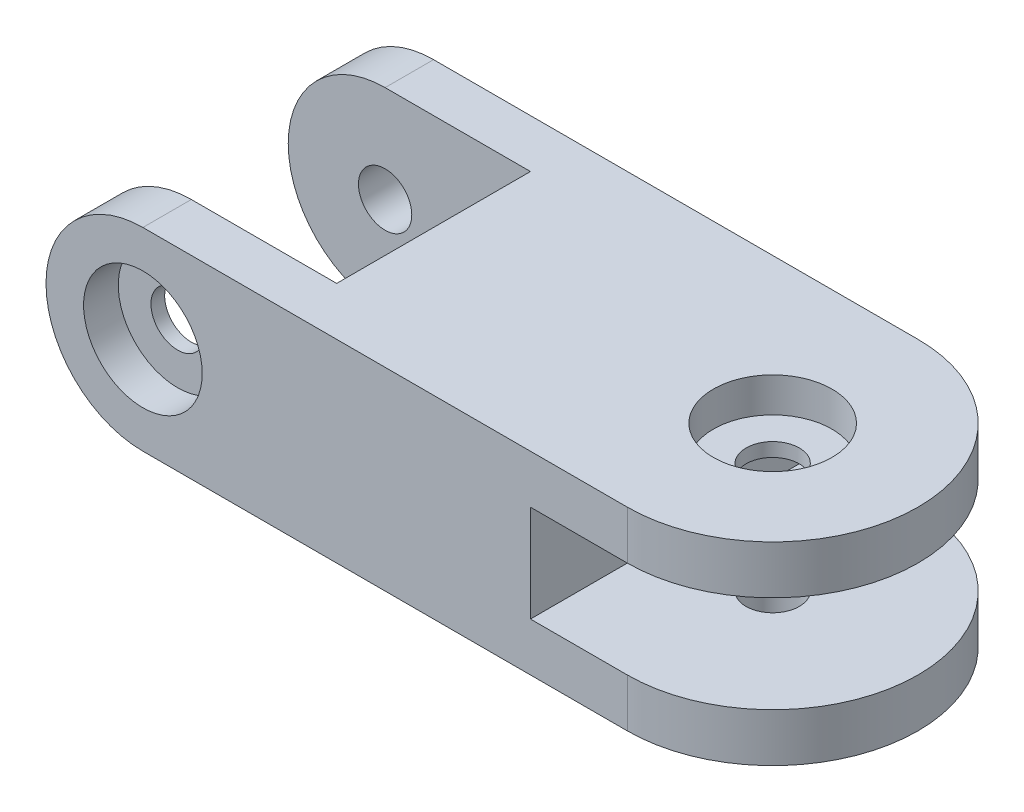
ISO-10303-21;
HEADER;
FILE_DESCRIPTION(('STEP AP214'),'2;1');
FILE_NAME('part.step','',(''),(''),'','','');
FILE_SCHEMA(('AUTOMOTIVE_DESIGN { 1 0 10303 214 1 1 1 1 }'));
ENDSEC;
DATA;
#1=APPLICATION_CONTEXT('core data for automotive mechanical design processes');
#2=APPLICATION_PROTOCOL_DEFINITION('international standard','automotive_design',2000,#1);
#3=PRODUCT_CONTEXT('',#1,'mechanical');
#4=PRODUCT('Part','Part','',(#3));
#5=PRODUCT_RELATED_PRODUCT_CATEGORY('part','',(#4));
#6=PRODUCT_DEFINITION_FORMATION('','',#4);
#7=PRODUCT_DEFINITION_CONTEXT('part definition',#1,'design');
#8=PRODUCT_DEFINITION('design','',#6,#7);
#9=PRODUCT_DEFINITION_SHAPE('','',#8);
#10=(LENGTH_UNIT() NAMED_UNIT(*) SI_UNIT(.MILLI.,.METRE.));
#11=(NAMED_UNIT(*) PLANE_ANGLE_UNIT() SI_UNIT($,.RADIAN.));
#12=(NAMED_UNIT(*) SI_UNIT($,.STERADIAN.) SOLID_ANGLE_UNIT());
#13=UNCERTAINTY_MEASURE_WITH_UNIT(LENGTH_MEASURE(1.E-05),#10,'distance_accuracy_value','');
#14=(GEOMETRIC_REPRESENTATION_CONTEXT(3) GLOBAL_UNCERTAINTY_ASSIGNED_CONTEXT((#13)) GLOBAL_UNIT_ASSIGNED_CONTEXT((#10,
#11,#12)) REPRESENTATION_CONTEXT('',''));
#15=CARTESIAN_POINT('',(0.,0.,0.));
#16=DIRECTION('',(0.,0.,1.));
#17=DIRECTION('',(1.,0.,0.));
#18=AXIS2_PLACEMENT_3D('',#15,#16,#17);
#19=CARTESIAN_POINT('',(0.,20.,-15.));
#20=DIRECTION('',(0.,0.,-1.));
#21=DIRECTION('',(-1.,0.,0.));
#22=AXIS2_PLACEMENT_3D('',#19,#20,#21);
#23=PLANE('',#22);
#24=DIRECTION('',(1.,0.,0.));
#25=VECTOR('',#24,1.);
#26=CARTESIAN_POINT('',(0.,0.,-15.));
#27=LINE('',#26,#25);
#28=CARTESIAN_POINT('',(10.,0.,-15.));
#29=VERTEX_POINT('',#28);
#30=CARTESIAN_POINT('',(60.,0.,-15.));
#31=VERTEX_POINT('',#30);
#32=EDGE_CURVE('E182',#29,#31,#27,.T.);
#33=ORIENTED_EDGE('',*,*,#32,.F.);
#34=CARTESIAN_POINT('',(10.,10.,-15.));
#35=DIRECTION('',(0.,0.,-1.));
#36=DIRECTION('',(-1.,0.,0.));
#37=AXIS2_PLACEMENT_3D('',#34,#35,#36);
#38=CIRCLE('',#37,10.);
#39=CARTESIAN_POINT('',(10.,20.,-15.));
#40=VERTEX_POINT('',#39);
#41=EDGE_CURVE('E213',#29,#40,#38,.T.);
#42=ORIENTED_EDGE('',*,*,#41,.T.);
#43=DIRECTION('',(-1.,0.,0.));
#44=VECTOR('',#43,1.);
#45=CARTESIAN_POINT('',(0.,20.,-15.));
#46=LINE('',#45,#44);
#47=CARTESIAN_POINT('',(60.,20.,-15.));
#48=VERTEX_POINT('',#47);
#49=EDGE_CURVE('E184',#48,#40,#46,.T.);
#50=ORIENTED_EDGE('',*,*,#49,.F.);
#51=DIRECTION('',(0.,-1.,0.));
#52=VECTOR('',#51,1.);
#53=CARTESIAN_POINT('',(60.,0.,-15.));
#54=LINE('',#53,#52);
#55=CARTESIAN_POINT('',(60.,15.,-15.));
#56=VERTEX_POINT('',#55);
#57=EDGE_CURVE('E196',#48,#56,#54,.T.);
#58=ORIENTED_EDGE('',*,*,#57,.T.);
#59=DIRECTION('',(1.,0.,0.));
#60=VECTOR('',#59,1.);
#61=CARTESIAN_POINT('',(0.,15.,-15.));
#62=LINE('',#61,#60);
#63=CARTESIAN_POINT('',(50.,15.,-15.));
#64=VERTEX_POINT('',#63);
#65=EDGE_CURVE('E204',#64,#56,#62,.T.);
#66=ORIENTED_EDGE('',*,*,#65,.F.);
#67=DIRECTION('',(0.,-1.,0.));
#68=VECTOR('',#67,1.);
#69=CARTESIAN_POINT('',(50.,15.,-15.));
#70=LINE('',#69,#68);
#71=CARTESIAN_POINT('',(50.,5.,-15.));
#72=VERTEX_POINT('',#71);
#73=EDGE_CURVE('E167',#64,#72,#70,.T.);
#74=ORIENTED_EDGE('',*,*,#73,.T.);
#75=DIRECTION('',(1.,0.,0.));
#76=VECTOR('',#75,1.);
#77=CARTESIAN_POINT('',(75.,5.,-15.));
#78=LINE('',#77,#76);
#79=CARTESIAN_POINT('',(60.,5.,-15.));
#80=VERTEX_POINT('',#79);
#81=EDGE_CURVE('E170',#72,#80,#78,.T.);
#82=ORIENTED_EDGE('',*,*,#81,.T.);
#83=EDGE_CURVE('E195',#80,#31,#54,.T.);
#84=ORIENTED_EDGE('',*,*,#83,.T.);
#85=EDGE_LOOP('',(#33,#42,#50,#58,#66,#74,#82,#84));
#86=FACE_BOUND('',#85,.T.);
#87=CARTESIAN_POINT('',(10.,10.,-15.));
#88=DIRECTION('',(0.,0.,1.));
#89=DIRECTION('',(1.,0.,0.));
#90=AXIS2_PLACEMENT_3D('',#87,#88,#89);
#91=CIRCLE('',#90,2.74999999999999);
#92=CARTESIAN_POINT('',(12.75,10.,-15.));
#93=VERTEX_POINT('',#92);
#94=EDGE_CURVE('E229',#93,#93,#91,.T.);
#95=ORIENTED_EDGE('',*,*,#94,.T.);
#96=EDGE_LOOP('',(#95));
#97=FACE_BOUND('',#96,.T.);
#98=ADVANCED_FACE('F33',(#86,#97),#23,.T.);
#99=CARTESIAN_POINT('',(10.,10.,-15.));
#100=DIRECTION('',(0.,0.,-1.));
#101=DIRECTION('',(-1.,0.,0.));
#102=AXIS2_PLACEMENT_3D('',#99,#100,#101);
#103=CYLINDRICAL_SURFACE('',#102,10.);
#104=DIRECTION('',(0.,0.,-1.));
#105=VECTOR('',#104,1.);
#106=CARTESIAN_POINT('',(10.,0.,15.));
#107=LINE('',#106,#105);
#108=CARTESIAN_POINT('',(10.,0.,-10.));
#109=VERTEX_POINT('',#108);
#110=EDGE_CURVE('E209',#109,#29,#107,.T.);
#111=ORIENTED_EDGE('',*,*,#110,.F.);
#112=CARTESIAN_POINT('',(10.,10.,-10.));
#113=DIRECTION('',(0.,0.,-1.));
#114=DIRECTION('',(-1.,0.,0.));
#115=AXIS2_PLACEMENT_3D('',#112,#113,#114);
#116=CIRCLE('',#115,10.);
#117=CARTESIAN_POINT('',(10.,20.,-10.));
#118=VERTEX_POINT('',#117);
#119=EDGE_CURVE('E157',#118,#109,#116,.F.);
#120=ORIENTED_EDGE('',*,*,#119,.F.);
#121=DIRECTION('',(0.,0.,-1.));
#122=VECTOR('',#121,1.);
#123=CARTESIAN_POINT('',(10.,20.,15.));
#124=LINE('',#123,#122);
#125=EDGE_CURVE('E207',#40,#118,#124,.F.);
#126=ORIENTED_EDGE('',*,*,#125,.F.);
#127=ORIENTED_EDGE('',*,*,#41,.F.);
#128=EDGE_LOOP('',(#111,#120,#126,#127));
#129=FACE_BOUND('',#128,.T.);
#130=ADVANCED_FACE('F283',(#129),#103,.T.);
#131=CARTESIAN_POINT('',(10.,10.,10.));
#132=DIRECTION('',(0.,0.,1.));
#133=DIRECTION('',(1.,0.,0.));
#134=AXIS2_PLACEMENT_3D('',#131,#132,#133);
#135=CIRCLE('',#134,10.);
#136=CARTESIAN_POINT('',(10.,0.,10.));
#137=VERTEX_POINT('',#136);
#138=CARTESIAN_POINT('',(10.,20.,10.));
#139=VERTEX_POINT('',#138);
#140=EDGE_CURVE('E50',#137,#139,#135,.F.);
#141=ORIENTED_EDGE('',*,*,#140,.F.);
#142=CARTESIAN_POINT('',(10.,0.,15.));
#143=VERTEX_POINT('',#142);
#144=EDGE_CURVE('E210',#143,#137,#107,.T.);
#145=ORIENTED_EDGE('',*,*,#144,.F.);
#146=CARTESIAN_POINT('',(10.,10.,15.));
#147=DIRECTION('',(0.,0.,-1.));
#148=DIRECTION('',(-1.,0.,0.));
#149=AXIS2_PLACEMENT_3D('',#146,#147,#148);
#150=CIRCLE('',#149,10.);
#151=CARTESIAN_POINT('',(10.,20.,15.));
#152=VERTEX_POINT('',#151);
#153=EDGE_CURVE('E42',#152,#143,#150,.F.);
#154=ORIENTED_EDGE('',*,*,#153,.F.);
#155=EDGE_CURVE('E206',#139,#152,#124,.F.);
#156=ORIENTED_EDGE('',*,*,#155,.F.);
#157=EDGE_LOOP('',(#141,#145,#154,#156));
#158=FACE_BOUND('',#157,.T.);
#159=ADVANCED_FACE('F35',(#158),#103,.T.);
#160=CARTESIAN_POINT('',(60.,0.,0.));
#161=DIRECTION('',(0.,1.,0.));
#162=DIRECTION('',(0.,0.,1.));
#163=AXIS2_PLACEMENT_3D('',#160,#161,#162);
#164=CYLINDRICAL_SURFACE('',#163,15.);
#165=CARTESIAN_POINT('',(60.,5.,0.));
#166=DIRECTION('',(0.,-1.,0.));
#167=DIRECTION('',(1.,0.,0.));
#168=AXIS2_PLACEMENT_3D('',#165,#166,#167);
#169=CIRCLE('',#168,15.);
#170=CARTESIAN_POINT('',(60.,5.,15.));
#171=VERTEX_POINT('',#170);
#172=EDGE_CURVE('E180',#171,#80,#169,.F.);
#173=ORIENTED_EDGE('',*,*,#172,.F.);
#174=DIRECTION('',(0.,1.,0.));
#175=VECTOR('',#174,1.);
#176=CARTESIAN_POINT('',(60.,20.,15.));
#177=LINE('',#176,#175);
#178=CARTESIAN_POINT('',(60.,0.,15.));
#179=VERTEX_POINT('',#178);
#180=EDGE_CURVE('E192',#179,#171,#177,.T.);
#181=ORIENTED_EDGE('',*,*,#180,.F.);
#182=CARTESIAN_POINT('',(60.,0.,0.));
#183=DIRECTION('',(0.,1.,0.));
#184=DIRECTION('',(0.,0.,1.));
#185=AXIS2_PLACEMENT_3D('',#182,#183,#184);
#186=CIRCLE('',#185,15.);
#187=EDGE_CURVE('E199',#31,#179,#186,.F.);
#188=ORIENTED_EDGE('',*,*,#187,.F.);
#189=ORIENTED_EDGE('',*,*,#83,.F.);
#190=EDGE_LOOP('',(#173,#181,#188,#189));
#191=FACE_BOUND('',#190,.T.);
#192=ADVANCED_FACE('F275',(#191),#164,.T.);
#193=CARTESIAN_POINT('',(60.,15.,0.));
#194=DIRECTION('',(0.,1.,0.));
#195=DIRECTION('',(-1.,0.,0.));
#196=AXIS2_PLACEMENT_3D('',#193,#194,#195);
#197=CIRCLE('',#196,15.);
#198=CARTESIAN_POINT('',(60.,15.,15.));
#199=VERTEX_POINT('',#198);
#200=EDGE_CURVE('E176',#56,#199,#197,.F.);
#201=ORIENTED_EDGE('',*,*,#200,.F.);
#202=ORIENTED_EDGE('',*,*,#57,.F.);
#203=CARTESIAN_POINT('',(60.,20.,0.));
#204=DIRECTION('',(0.,-1.,0.));
#205=DIRECTION('',(0.,0.,-1.));
#206=AXIS2_PLACEMENT_3D('',#203,#204,#205);
#207=CIRCLE('',#206,15.);
#208=CARTESIAN_POINT('',(60.,20.,15.));
#209=VERTEX_POINT('',#208);
#210=EDGE_CURVE('E202',#209,#48,#207,.F.);
#211=ORIENTED_EDGE('',*,*,#210,.F.);
#212=EDGE_CURVE('E191',#199,#209,#177,.T.);
#213=ORIENTED_EDGE('',*,*,#212,.F.);
#214=EDGE_LOOP('',(#201,#202,#211,#213));
#215=FACE_BOUND('',#214,.T.);
#216=ADVANCED_FACE('F290',(#215),#164,.T.);
#217=CARTESIAN_POINT('',(0.,0.,15.));
#218=DIRECTION('',(0.,1.,0.));
#219=DIRECTION('',(0.,0.,1.));
#220=AXIS2_PLACEMENT_3D('',#217,#218,#219);
#221=PLANE('',#220);
#222=CARTESIAN_POINT('',(60.,0.,0.));
#223=DIRECTION('',(0.,1.,0.));
#224=DIRECTION('',(0.,0.,1.));
#225=AXIS2_PLACEMENT_3D('',#222,#223,#224);
#226=CIRCLE('',#225,2.75);
#227=CARTESIAN_POINT('',(60.,0.,2.75));
#228=VERTEX_POINT('',#227);
#229=EDGE_CURVE('E244',#228,#228,#226,.T.);
#230=ORIENTED_EDGE('',*,*,#229,.T.);
#231=EDGE_LOOP('',(#230));
#232=FACE_BOUND('',#231,.T.);
#233=DIRECTION('',(0.,0.,-1.));
#234=VECTOR('',#233,1.);
#235=CARTESIAN_POINT('',(25.,0.,15.));
#236=LINE('',#235,#234);
#237=CARTESIAN_POINT('',(25.,0.,10.));
#238=VERTEX_POINT('',#237);
#239=CARTESIAN_POINT('',(25.,0.,-10.));
#240=VERTEX_POINT('',#239);
#241=EDGE_CURVE('E131',#238,#240,#236,.T.);
#242=ORIENTED_EDGE('',*,*,#241,.T.);
#243=DIRECTION('',(-1.,0.,0.));
#244=VECTOR('',#243,1.);
#245=CARTESIAN_POINT('',(0.,0.,-10.));
#246=LINE('',#245,#244);
#247=EDGE_CURVE('E154',#240,#109,#246,.T.);
#248=ORIENTED_EDGE('',*,*,#247,.T.);
#249=ORIENTED_EDGE('',*,*,#110,.T.);
#250=ORIENTED_EDGE('',*,*,#32,.T.);
#251=ORIENTED_EDGE('',*,*,#187,.T.);
#252=DIRECTION('',(1.,0.,0.));
#253=VECTOR('',#252,1.);
#254=CARTESIAN_POINT('',(0.,0.,15.));
#255=LINE('',#254,#253);
#256=EDGE_CURVE('E187',#143,#179,#255,.T.);
#257=ORIENTED_EDGE('',*,*,#256,.F.);
#258=ORIENTED_EDGE('',*,*,#144,.T.);
#259=DIRECTION('',(1.,0.,0.));
#260=VECTOR('',#259,1.);
#261=CARTESIAN_POINT('',(0.,0.,10.));
#262=LINE('',#261,#260);
#263=EDGE_CURVE('E149',#137,#238,#262,.T.);
#264=ORIENTED_EDGE('',*,*,#263,.T.);
#265=EDGE_LOOP('',(#242,#248,#249,#250,#251,#257,#258,#264));
#266=FACE_BOUND('',#265,.T.);
#267=ADVANCED_FACE('F248',(#232,#266),#221,.F.);
#268=CARTESIAN_POINT('',(0.,20.,15.));
#269=DIRECTION('',(0.,-1.,0.));
#270=DIRECTION('',(0.,0.,-1.));
#271=AXIS2_PLACEMENT_3D('',#268,#269,#270);
#272=PLANE('',#271);
#273=CARTESIAN_POINT('',(60.,20.,0.));
#274=DIRECTION('',(0.,1.,0.));
#275=DIRECTION('',(0.,0.,1.));
#276=AXIS2_PLACEMENT_3D('',#273,#274,#275);
#277=CIRCLE('',#276,6.12);
#278=CARTESIAN_POINT('',(60.,20.,6.12));
#279=VERTEX_POINT('',#278);
#280=EDGE_CURVE('E235',#279,#279,#277,.T.);
#281=ORIENTED_EDGE('',*,*,#280,.F.);
#282=EDGE_LOOP('',(#281));
#283=FACE_BOUND('',#282,.T.);
#284=ORIENTED_EDGE('',*,*,#125,.T.);
#285=DIRECTION('',(-1.,0.,0.));
#286=VECTOR('',#285,1.);
#287=CARTESIAN_POINT('',(0.,20.,-10.));
#288=LINE('',#287,#286);
#289=CARTESIAN_POINT('',(25.,20.,-10.));
#290=VERTEX_POINT('',#289);
#291=EDGE_CURVE('E134',#290,#118,#288,.T.);
#292=ORIENTED_EDGE('',*,*,#291,.F.);
#293=DIRECTION('',(0.,0.,-1.));
#294=VECTOR('',#293,1.);
#295=CARTESIAN_POINT('',(25.,20.,-10.));
#296=LINE('',#295,#294);
#297=CARTESIAN_POINT('',(25.,20.,10.));
#298=VERTEX_POINT('',#297);
#299=EDGE_CURVE('E128',#298,#290,#296,.T.);
#300=ORIENTED_EDGE('',*,*,#299,.F.);
#301=DIRECTION('',(-1.,0.,0.));
#302=VECTOR('',#301,1.);
#303=CARTESIAN_POINT('',(0.,20.,10.));
#304=LINE('',#303,#302);
#305=EDGE_CURVE('E11',#298,#139,#304,.T.);
#306=ORIENTED_EDGE('',*,*,#305,.T.);
#307=ORIENTED_EDGE('',*,*,#155,.T.);
#308=DIRECTION('',(-1.,0.,0.));
#309=VECTOR('',#308,1.);
#310=CARTESIAN_POINT('',(0.,20.,15.));
#311=LINE('',#310,#309);
#312=EDGE_CURVE('E189',#209,#152,#311,.T.);
#313=ORIENTED_EDGE('',*,*,#312,.F.);
#314=ORIENTED_EDGE('',*,*,#210,.T.);
#315=ORIENTED_EDGE('',*,*,#49,.T.);
#316=EDGE_LOOP('',(#284,#292,#300,#306,#307,#313,#314,#315));
#317=FACE_BOUND('',#316,.T.);
#318=ADVANCED_FACE('F140',(#283,#317),#272,.F.);
#319=CARTESIAN_POINT('',(0.,20.,15.));
#320=DIRECTION('',(0.,0.,-1.));
#321=DIRECTION('',(-1.,0.,0.));
#322=AXIS2_PLACEMENT_3D('',#319,#320,#321);
#323=PLANE('',#322);
#324=CARTESIAN_POINT('',(10.,10.,15.));
#325=DIRECTION('',(0.,0.,1.));
#326=DIRECTION('',(1.,0.,0.));
#327=AXIS2_PLACEMENT_3D('',#324,#325,#326);
#328=CIRCLE('',#327,6.12);
#329=CARTESIAN_POINT('',(16.12,10.,15.));
#330=VERTEX_POINT('',#329);
#331=EDGE_CURVE('E216',#330,#330,#328,.T.);
#332=ORIENTED_EDGE('',*,*,#331,.F.);
#333=EDGE_LOOP('',(#332));
#334=FACE_BOUND('',#333,.T.);
#335=ORIENTED_EDGE('',*,*,#312,.T.);
#336=ORIENTED_EDGE('',*,*,#153,.T.);
#337=ORIENTED_EDGE('',*,*,#256,.T.);
#338=ORIENTED_EDGE('',*,*,#180,.T.);
#339=DIRECTION('',(1.,0.,0.));
#340=VECTOR('',#339,1.);
#341=CARTESIAN_POINT('',(75.,5.,15.));
#342=LINE('',#341,#340);
#343=CARTESIAN_POINT('',(50.,5.,15.));
#344=VERTEX_POINT('',#343);
#345=EDGE_CURVE('E164',#344,#171,#342,.T.);
#346=ORIENTED_EDGE('',*,*,#345,.F.);
#347=DIRECTION('',(0.,-1.,0.));
#348=VECTOR('',#347,1.);
#349=CARTESIAN_POINT('',(50.,15.,15.));
#350=LINE('',#349,#348);
#351=CARTESIAN_POINT('',(50.,15.,15.));
#352=VERTEX_POINT('',#351);
#353=EDGE_CURVE('E161',#352,#344,#350,.T.);
#354=ORIENTED_EDGE('',*,*,#353,.F.);
#355=DIRECTION('',(-1.,0.,0.));
#356=VECTOR('',#355,1.);
#357=CARTESIAN_POINT('',(75.,15.,15.));
#358=LINE('',#357,#356);
#359=EDGE_CURVE('E159',#199,#352,#358,.T.);
#360=ORIENTED_EDGE('',*,*,#359,.F.);
#361=ORIENTED_EDGE('',*,*,#212,.T.);
#362=EDGE_LOOP('',(#335,#336,#337,#338,#346,#354,#360,#361));
#363=FACE_BOUND('',#362,.T.);
#364=ADVANCED_FACE('F262',(#334,#363),#323,.F.);
#365=CARTESIAN_POINT('',(75.,5.,-15.));
#366=DIRECTION('',(0.,-1.,0.));
#367=DIRECTION('',(1.,0.,0.));
#368=AXIS2_PLACEMENT_3D('',#365,#366,#367);
#369=PLANE('',#368);
#370=CARTESIAN_POINT('',(60.,5.,0.));
#371=DIRECTION('',(0.,-1.,0.));
#372=DIRECTION('',(1.,0.,0.));
#373=AXIS2_PLACEMENT_3D('',#370,#371,#372);
#374=CIRCLE('',#373,2.75);
#375=CARTESIAN_POINT('',(62.75,5.,0.));
#376=VERTEX_POINT('',#375);
#377=EDGE_CURVE('E232',#376,#376,#374,.T.);
#378=ORIENTED_EDGE('',*,*,#377,.T.);
#379=EDGE_LOOP('',(#378));
#380=FACE_BOUND('',#379,.T.);
#381=ORIENTED_EDGE('',*,*,#172,.T.);
#382=ORIENTED_EDGE('',*,*,#81,.F.);
#383=DIRECTION('',(0.,0.,1.));
#384=VECTOR('',#383,1.);
#385=CARTESIAN_POINT('',(50.,5.,-15.));
#386=LINE('',#385,#384);
#387=EDGE_CURVE('E174',#72,#344,#386,.T.);
#388=ORIENTED_EDGE('',*,*,#387,.T.);
#389=ORIENTED_EDGE('',*,*,#345,.T.);
#390=EDGE_LOOP('',(#381,#382,#388,#389));
#391=FACE_BOUND('',#390,.T.);
#392=ADVANCED_FACE('F258',(#380,#391),#369,.F.);
#393=CARTESIAN_POINT('',(50.,15.,-15.));
#394=DIRECTION('',(-1.,0.,0.));
#395=DIRECTION('',(0.,0.,1.));
#396=AXIS2_PLACEMENT_3D('',#393,#394,#395);
#397=PLANE('',#396);
#398=ORIENTED_EDGE('',*,*,#353,.T.);
#399=ORIENTED_EDGE('',*,*,#387,.F.);
#400=ORIENTED_EDGE('',*,*,#73,.F.);
#401=DIRECTION('',(0.,0.,1.));
#402=VECTOR('',#401,1.);
#403=CARTESIAN_POINT('',(50.,15.,-15.));
#404=LINE('',#403,#402);
#405=EDGE_CURVE('E173',#64,#352,#404,.T.);
#406=ORIENTED_EDGE('',*,*,#405,.T.);
#407=EDGE_LOOP('',(#398,#399,#400,#406));
#408=FACE_BOUND('',#407,.T.);
#409=ADVANCED_FACE('F261',(#408),#397,.F.);
#410=CARTESIAN_POINT('',(75.,15.,-15.));
#411=DIRECTION('',(0.,1.,0.));
#412=DIRECTION('',(-1.,0.,0.));
#413=AXIS2_PLACEMENT_3D('',#410,#411,#412);
#414=PLANE('',#413);
#415=CARTESIAN_POINT('',(60.,15.,0.));
#416=DIRECTION('',(0.,1.,0.));
#417=DIRECTION('',(-1.,0.,0.));
#418=AXIS2_PLACEMENT_3D('',#415,#416,#417);
#419=CIRCLE('',#418,2.75);
#420=CARTESIAN_POINT('',(57.25,15.,0.));
#421=VERTEX_POINT('',#420);
#422=EDGE_CURVE('E37',#421,#421,#419,.T.);
#423=ORIENTED_EDGE('',*,*,#422,.T.);
#424=EDGE_LOOP('',(#423));
#425=FACE_BOUND('',#424,.T.);
#426=ORIENTED_EDGE('',*,*,#200,.T.);
#427=ORIENTED_EDGE('',*,*,#359,.T.);
#428=ORIENTED_EDGE('',*,*,#405,.F.);
#429=ORIENTED_EDGE('',*,*,#65,.T.);
#430=EDGE_LOOP('',(#426,#427,#428,#429));
#431=FACE_BOUND('',#430,.T.);
#432=ADVANCED_FACE('F293',(#425,#431),#414,.F.);
#433=CARTESIAN_POINT('',(25.,-10.,-10.));
#434=DIRECTION('',(1.,0.,0.));
#435=DIRECTION('',(0.,0.,-1.));
#436=AXIS2_PLACEMENT_3D('',#433,#434,#435);
#437=PLANE('',#436);
#438=DIRECTION('',(0.,1.,0.));
#439=VECTOR('',#438,1.);
#440=CARTESIAN_POINT('',(25.,-10.,10.));
#441=LINE('',#440,#439);
#442=EDGE_CURVE('E124',#238,#298,#441,.T.);
#443=ORIENTED_EDGE('',*,*,#442,.T.);
#444=ORIENTED_EDGE('',*,*,#299,.T.);
#445=DIRECTION('',(0.,1.,0.));
#446=VECTOR('',#445,1.);
#447=CARTESIAN_POINT('',(25.,-10.,-10.));
#448=LINE('',#447,#446);
#449=EDGE_CURVE('E133',#240,#290,#448,.T.);
#450=ORIENTED_EDGE('',*,*,#449,.F.);
#451=ORIENTED_EDGE('',*,*,#241,.F.);
#452=EDGE_LOOP('',(#443,#444,#450,#451));
#453=FACE_BOUND('',#452,.T.);
#454=ADVANCED_FACE('F125',(#453),#437,.F.);
#455=CARTESIAN_POINT('',(0.,-10.,-10.));
#456=DIRECTION('',(0.,0.,-1.));
#457=DIRECTION('',(-1.,0.,0.));
#458=AXIS2_PLACEMENT_3D('',#455,#456,#457);
#459=PLANE('',#458);
#460=CARTESIAN_POINT('',(10.,10.,-10.));
#461=DIRECTION('',(0.,0.,-1.));
#462=DIRECTION('',(-1.,0.,0.));
#463=AXIS2_PLACEMENT_3D('',#460,#461,#462);
#464=CIRCLE('',#463,2.75);
#465=CARTESIAN_POINT('',(7.25000000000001,10.,-10.));
#466=VERTEX_POINT('',#465);
#467=EDGE_CURVE('E141',#466,#466,#464,.T.);
#468=ORIENTED_EDGE('',*,*,#467,.T.);
#469=EDGE_LOOP('',(#468));
#470=FACE_BOUND('',#469,.T.);
#471=ORIENTED_EDGE('',*,*,#119,.T.);
#472=ORIENTED_EDGE('',*,*,#247,.F.);
#473=ORIENTED_EDGE('',*,*,#449,.T.);
#474=ORIENTED_EDGE('',*,*,#291,.T.);
#475=EDGE_LOOP('',(#471,#472,#473,#474));
#476=FACE_BOUND('',#475,.T.);
#477=ADVANCED_FACE('F319',(#470,#476),#459,.F.);
#478=CARTESIAN_POINT('',(0.,-10.,10.));
#479=DIRECTION('',(0.,0.,1.));
#480=DIRECTION('',(1.,0.,0.));
#481=AXIS2_PLACEMENT_3D('',#478,#479,#480);
#482=PLANE('',#481);
#483=CARTESIAN_POINT('',(10.,10.,10.));
#484=DIRECTION('',(0.,0.,1.));
#485=DIRECTION('',(1.,0.,0.));
#486=AXIS2_PLACEMENT_3D('',#483,#484,#485);
#487=CIRCLE('',#486,2.75);
#488=CARTESIAN_POINT('',(12.75,10.,10.));
#489=VERTEX_POINT('',#488);
#490=EDGE_CURVE('E145',#489,#489,#487,.T.);
#491=ORIENTED_EDGE('',*,*,#490,.T.);
#492=EDGE_LOOP('',(#491));
#493=FACE_BOUND('',#492,.T.);
#494=ORIENTED_EDGE('',*,*,#140,.T.);
#495=ORIENTED_EDGE('',*,*,#305,.F.);
#496=ORIENTED_EDGE('',*,*,#442,.F.);
#497=ORIENTED_EDGE('',*,*,#263,.F.);
#498=EDGE_LOOP('',(#494,#495,#496,#497));
#499=FACE_BOUND('',#498,.T.);
#500=ADVANCED_FACE('F136',(#493,#499),#482,.F.);
#501=CARTESIAN_POINT('',(12.75,10.,11.42));
#502=DIRECTION('',(0.,0.,-1.));
#503=DIRECTION('',(-1.,0.,0.));
#504=AXIS2_PLACEMENT_3D('',#501,#502,#503);
#505=PLANE('',#504);
#506=CARTESIAN_POINT('',(10.,10.,11.42));
#507=DIRECTION('',(0.,0.,1.));
#508=DIRECTION('',(1.,0.,0.));
#509=AXIS2_PLACEMENT_3D('',#506,#507,#508);
#510=CIRCLE('',#509,2.75);
#511=CARTESIAN_POINT('',(12.75,10.,11.42));
#512=VERTEX_POINT('',#511);
#513=EDGE_CURVE('E224',#512,#512,#510,.T.);
#514=ORIENTED_EDGE('',*,*,#513,.F.);
#515=EDGE_LOOP('',(#514));
#516=FACE_BOUND('',#515,.T.);
#517=CARTESIAN_POINT('',(10.,10.,11.42));
#518=DIRECTION('',(0.,0.,1.));
#519=DIRECTION('',(1.,0.,0.));
#520=AXIS2_PLACEMENT_3D('',#517,#518,#519);
#521=CIRCLE('',#520,6.12);
#522=CARTESIAN_POINT('',(16.12,10.,11.42));
#523=VERTEX_POINT('',#522);
#524=EDGE_CURVE('E220',#523,#523,#521,.T.);
#525=ORIENTED_EDGE('',*,*,#524,.T.);
#526=EDGE_LOOP('',(#525));
#527=FACE_BOUND('',#526,.T.);
#528=ADVANCED_FACE('F318',(#516,#527),#505,.F.);
#529=CARTESIAN_POINT('',(10.,10.,15.));
#530=DIRECTION('',(0.,0.,1.));
#531=DIRECTION('',(1.,0.,0.));
#532=AXIS2_PLACEMENT_3D('',#529,#530,#531);
#533=CYLINDRICAL_SURFACE('',#532,6.12);
#534=ORIENTED_EDGE('',*,*,#524,.F.);
#535=EDGE_LOOP('',(#534));
#536=FACE_BOUND('',#535,.T.);
#537=ORIENTED_EDGE('',*,*,#331,.T.);
#538=EDGE_LOOP('',(#537));
#539=FACE_BOUND('',#538,.T.);
#540=ADVANCED_FACE('F325',(#536,#539),#533,.F.);
#541=CARTESIAN_POINT('',(10.,10.,15.));
#542=DIRECTION('',(0.,0.,1.));
#543=DIRECTION('',(1.,0.,0.));
#544=AXIS2_PLACEMENT_3D('',#541,#542,#543);
#545=CYLINDRICAL_SURFACE('',#544,2.75);
#546=ORIENTED_EDGE('',*,*,#513,.T.);
#547=EDGE_LOOP('',(#546));
#548=FACE_BOUND('',#547,.T.);
#549=ORIENTED_EDGE('',*,*,#490,.F.);
#550=EDGE_LOOP('',(#549));
#551=FACE_BOUND('',#550,.T.);
#552=ADVANCED_FACE('F328',(#548,#551),#545,.F.);
#553=ORIENTED_EDGE('',*,*,#94,.F.);
#554=EDGE_LOOP('',(#553));
#555=FACE_BOUND('',#554,.T.);
#556=ORIENTED_EDGE('',*,*,#467,.F.);
#557=EDGE_LOOP('',(#556));
#558=FACE_BOUND('',#557,.T.);
#559=ADVANCED_FACE('F333',(#555,#558),#545,.F.);
#560=CARTESIAN_POINT('',(62.75,16.42,0.));
#561=DIRECTION('',(0.,-1.,0.));
#562=DIRECTION('',(0.,0.,-1.));
#563=AXIS2_PLACEMENT_3D('',#560,#561,#562);
#564=PLANE('',#563);
#565=CARTESIAN_POINT('',(60.,16.42,0.));
#566=DIRECTION('',(0.,1.,0.));
#567=DIRECTION('',(0.,0.,1.));
#568=AXIS2_PLACEMENT_3D('',#565,#566,#567);
#569=CIRCLE('',#568,2.75);
#570=CARTESIAN_POINT('',(60.,16.42,2.75));
#571=VERTEX_POINT('',#570);
#572=EDGE_CURVE('E241',#571,#571,#569,.T.);
#573=ORIENTED_EDGE('',*,*,#572,.F.);
#574=EDGE_LOOP('',(#573));
#575=FACE_BOUND('',#574,.T.);
#576=CARTESIAN_POINT('',(60.,16.42,0.));
#577=DIRECTION('',(0.,1.,0.));
#578=DIRECTION('',(0.,0.,1.));
#579=AXIS2_PLACEMENT_3D('',#576,#577,#578);
#580=CIRCLE('',#579,6.12);
#581=CARTESIAN_POINT('',(60.,16.42,6.12));
#582=VERTEX_POINT('',#581);
#583=EDGE_CURVE('E238',#582,#582,#580,.T.);
#584=ORIENTED_EDGE('',*,*,#583,.T.);
#585=EDGE_LOOP('',(#584));
#586=FACE_BOUND('',#585,.T.);
#587=ADVANCED_FACE('F336',(#575,#586),#564,.F.);
#588=CARTESIAN_POINT('',(60.,20.,0.));
#589=DIRECTION('',(0.,1.,0.));
#590=DIRECTION('',(0.,0.,1.));
#591=AXIS2_PLACEMENT_3D('',#588,#589,#590);
#592=CYLINDRICAL_SURFACE('',#591,6.12);
#593=ORIENTED_EDGE('',*,*,#583,.F.);
#594=EDGE_LOOP('',(#593));
#595=FACE_BOUND('',#594,.T.);
#596=ORIENTED_EDGE('',*,*,#280,.T.);
#597=EDGE_LOOP('',(#596));
#598=FACE_BOUND('',#597,.T.);
#599=ADVANCED_FACE('F338',(#595,#598),#592,.F.);
#600=CARTESIAN_POINT('',(60.,20.,0.));
#601=DIRECTION('',(0.,1.,0.));
#602=DIRECTION('',(0.,0.,1.));
#603=AXIS2_PLACEMENT_3D('',#600,#601,#602);
#604=CYLINDRICAL_SURFACE('',#603,2.75);
#605=ORIENTED_EDGE('',*,*,#572,.T.);
#606=EDGE_LOOP('',(#605));
#607=FACE_BOUND('',#606,.T.);
#608=ORIENTED_EDGE('',*,*,#422,.F.);
#609=EDGE_LOOP('',(#608));
#610=FACE_BOUND('',#609,.T.);
#611=ADVANCED_FACE('F254',(#607,#610),#604,.F.);
#612=ORIENTED_EDGE('',*,*,#229,.F.);
#613=EDGE_LOOP('',(#612));
#614=FACE_BOUND('',#613,.T.);
#615=ORIENTED_EDGE('',*,*,#377,.F.);
#616=EDGE_LOOP('',(#615));
#617=FACE_BOUND('',#616,.T.);
#618=ADVANCED_FACE('F251',(#614,#617),#604,.F.);
#619=CLOSED_SHELL('',(#98,#130,#159,#192,#216,#267,#318,#364,#392,#409,#432,#454,#477,#500,#528,
#540,#552,#559,#587,#599,#611,#618));
#620=MANIFOLD_SOLID_BREP('B2',#619);
#621=ADVANCED_BREP_SHAPE_REPRESENTATION('',(#18,#620),#14);
#622=SHAPE_DEFINITION_REPRESENTATION(#9,#621);
ENDSEC;
END-ISO-10303-21;
